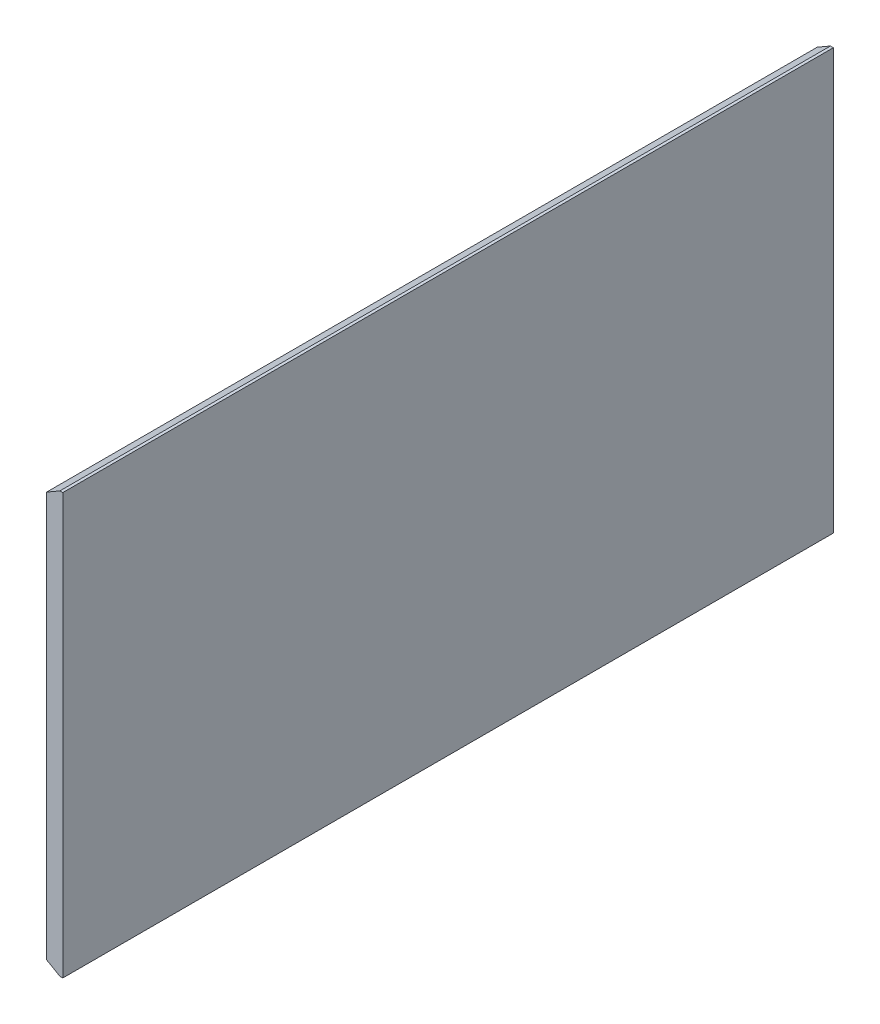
ISO-10303-21;
HEADER;
FILE_DESCRIPTION(('STEP AP214'),'2;1');
FILE_NAME('part.step','',(''),(''),'','','');
FILE_SCHEMA(('AUTOMOTIVE_DESIGN { 1 0 10303 214 1 1 1 1 }'));
ENDSEC;
DATA;
#1=APPLICATION_CONTEXT('core data for automotive mechanical design processes');
#2=APPLICATION_PROTOCOL_DEFINITION('international standard','automotive_design',2000,#1);
#3=PRODUCT_CONTEXT('',#1,'mechanical');
#4=PRODUCT('Part','Part','',(#3));
#5=PRODUCT_RELATED_PRODUCT_CATEGORY('part','',(#4));
#6=PRODUCT_DEFINITION_FORMATION('','',#4);
#7=PRODUCT_DEFINITION_CONTEXT('part definition',#1,'design');
#8=PRODUCT_DEFINITION('design','',#6,#7);
#9=PRODUCT_DEFINITION_SHAPE('','',#8);
#10=(LENGTH_UNIT() NAMED_UNIT(*) SI_UNIT(.MILLI.,.METRE.));
#11=(NAMED_UNIT(*) PLANE_ANGLE_UNIT() SI_UNIT($,.RADIAN.));
#12=(NAMED_UNIT(*) SI_UNIT($,.STERADIAN.) SOLID_ANGLE_UNIT());
#13=UNCERTAINTY_MEASURE_WITH_UNIT(LENGTH_MEASURE(1.E-05),#10,'distance_accuracy_value','');
#14=(GEOMETRIC_REPRESENTATION_CONTEXT(3) GLOBAL_UNCERTAINTY_ASSIGNED_CONTEXT((#13)) GLOBAL_UNIT_ASSIGNED_CONTEXT((#10,
#11,#12)) REPRESENTATION_CONTEXT('',''));
#15=CARTESIAN_POINT('',(0.,0.,0.));
#16=DIRECTION('',(0.,0.,1.));
#17=DIRECTION('',(1.,0.,0.));
#18=AXIS2_PLACEMENT_3D('',#15,#16,#17);
#19=CARTESIAN_POINT('',(22.225,579.,1061.35));
#20=DIRECTION('',(0.,-1.,0.));
#21=DIRECTION('',(0.,0.,-1.));
#22=AXIS2_PLACEMENT_3D('',#19,#20,#21);
#23=PLANE('',#22);
#24=DIRECTION('',(-1.,0.,0.));
#25=VECTOR('',#24,1.);
#26=CARTESIAN_POINT('',(22.225,579.,-1061.35));
#27=LINE('',#26,#25);
#28=CARTESIAN_POINT('',(22.225,579.,-1061.35));
#29=VERTEX_POINT('',#28);
#30=CARTESIAN_POINT('',(14.148066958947,579.,-1061.35));
#31=VERTEX_POINT('',#30);
#32=EDGE_CURVE('E154',#29,#31,#27,.T.);
#33=ORIENTED_EDGE('',*,*,#32,.T.);
#34=DIRECTION('',(0.,0.,1.));
#35=VECTOR('',#34,1.);
#36=CARTESIAN_POINT('',(14.148066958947,579.,1061.35));
#37=LINE('',#36,#35);
#38=CARTESIAN_POINT('',(14.148066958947,579.,1061.35));
#39=VERTEX_POINT('',#38);
#40=EDGE_CURVE('E130',#31,#39,#37,.T.);
#41=ORIENTED_EDGE('',*,*,#40,.T.);
#42=DIRECTION('',(-1.,0.,0.));
#43=VECTOR('',#42,1.);
#44=CARTESIAN_POINT('',(22.225,579.,1061.35));
#45=LINE('',#44,#43);
#46=CARTESIAN_POINT('',(22.225,579.,1061.35));
#47=VERTEX_POINT('',#46);
#48=EDGE_CURVE('E106',#47,#39,#45,.T.);
#49=ORIENTED_EDGE('',*,*,#48,.F.);
#50=DIRECTION('',(0.,0.,1.));
#51=VECTOR('',#50,1.);
#52=CARTESIAN_POINT('',(22.225,579.,1061.35));
#53=LINE('',#52,#51);
#54=EDGE_CURVE('E113',#29,#47,#53,.T.);
#55=ORIENTED_EDGE('',*,*,#54,.F.);
#56=EDGE_LOOP('',(#33,#41,#49,#55));
#57=FACE_BOUND('',#56,.T.);
#58=ADVANCED_FACE('F44',(#57),#23,.F.);
#59=CARTESIAN_POINT('',(22.225,-579.,1061.35));
#60=DIRECTION('',(0.,0.,-1.));
#61=DIRECTION('',(-1.,0.,0.));
#62=AXIS2_PLACEMENT_3D('',#59,#60,#61);
#63=PLANE('',#62);
#64=ORIENTED_EDGE('',*,*,#48,.T.);
#65=DIRECTION('',(0.866025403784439,0.5,0.));
#66=VECTOR('',#65,1.);
#67=CARTESIAN_POINT('',(14.148066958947,579.,1061.35));
#68=LINE('',#67,#66);
#69=CARTESIAN_POINT('',(-22.225,558.,1061.35));
#70=VERTEX_POINT('',#69);
#71=EDGE_CURVE('E142',#39,#70,#68,.F.);
#72=ORIENTED_EDGE('',*,*,#71,.T.);
#73=DIRECTION('',(0.,-1.,0.));
#74=VECTOR('',#73,1.);
#75=CARTESIAN_POINT('',(-22.225,-579.,1061.35));
#76=LINE('',#75,#74);
#77=CARTESIAN_POINT('',(-22.225,-558.,1061.35));
#78=VERTEX_POINT('',#77);
#79=EDGE_CURVE('E163',#70,#78,#76,.T.);
#80=ORIENTED_EDGE('',*,*,#79,.T.);
#81=DIRECTION('',(-0.866025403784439,0.5,0.));
#82=VECTOR('',#81,1.);
#83=CARTESIAN_POINT('',(14.148066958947,-579.,1061.35));
#84=LINE('',#83,#82);
#85=CARTESIAN_POINT('',(14.148066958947,-579.,1061.35));
#86=VERTEX_POINT('',#85);
#87=EDGE_CURVE('E132',#78,#86,#84,.F.);
#88=ORIENTED_EDGE('',*,*,#87,.T.);
#89=DIRECTION('',(-1.,0.,0.));
#90=VECTOR('',#89,1.);
#91=CARTESIAN_POINT('',(22.225,-579.,1061.35));
#92=LINE('',#91,#90);
#93=CARTESIAN_POINT('',(22.225,-579.,1061.35));
#94=VERTEX_POINT('',#93);
#95=EDGE_CURVE('E108',#94,#86,#92,.T.);
#96=ORIENTED_EDGE('',*,*,#95,.F.);
#97=DIRECTION('',(0.,-1.,0.));
#98=VECTOR('',#97,1.);
#99=CARTESIAN_POINT('',(22.225,-579.,1061.35));
#100=LINE('',#99,#98);
#101=EDGE_CURVE('E105',#47,#94,#100,.T.);
#102=ORIENTED_EDGE('',*,*,#101,.F.);
#103=EDGE_LOOP('',(#64,#72,#80,#88,#96,#102));
#104=FACE_BOUND('',#103,.T.);
#105=ADVANCED_FACE('F104',(#104),#63,.F.);
#106=CARTESIAN_POINT('',(22.225,-579.,1061.35));
#107=DIRECTION('',(0.,1.,0.));
#108=DIRECTION('',(0.,0.,1.));
#109=AXIS2_PLACEMENT_3D('',#106,#107,#108);
#110=PLANE('',#109);
#111=ORIENTED_EDGE('',*,*,#95,.T.);
#112=DIRECTION('',(0.,0.,-1.));
#113=VECTOR('',#112,1.);
#114=CARTESIAN_POINT('',(14.148066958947,-579.,1061.35));
#115=LINE('',#114,#113);
#116=CARTESIAN_POINT('',(14.148066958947,-579.,-1061.35));
#117=VERTEX_POINT('',#116);
#118=EDGE_CURVE('E11',#86,#117,#115,.T.);
#119=ORIENTED_EDGE('',*,*,#118,.T.);
#120=DIRECTION('',(-1.,0.,0.));
#121=VECTOR('',#120,1.);
#122=CARTESIAN_POINT('',(22.225,-579.,-1061.35));
#123=LINE('',#122,#121);
#124=CARTESIAN_POINT('',(22.225,-579.,-1061.35));
#125=VERTEX_POINT('',#124);
#126=EDGE_CURVE('E134',#125,#117,#123,.T.);
#127=ORIENTED_EDGE('',*,*,#126,.F.);
#128=DIRECTION('',(0.,0.,-1.));
#129=VECTOR('',#128,1.);
#130=CARTESIAN_POINT('',(22.225,-579.,1061.35));
#131=LINE('',#130,#129);
#132=EDGE_CURVE('E115',#94,#125,#131,.T.);
#133=ORIENTED_EDGE('',*,*,#132,.F.);
#134=EDGE_LOOP('',(#111,#119,#127,#133));
#135=FACE_BOUND('',#134,.T.);
#136=ADVANCED_FACE('F176',(#135),#110,.F.);
#137=CARTESIAN_POINT('',(22.225,-579.,-1061.35));
#138=DIRECTION('',(0.,0.,1.));
#139=DIRECTION('',(1.,0.,0.));
#140=AXIS2_PLACEMENT_3D('',#137,#138,#139);
#141=PLANE('',#140);
#142=DIRECTION('',(0.,1.,0.));
#143=VECTOR('',#142,1.);
#144=CARTESIAN_POINT('',(-22.225,-579.,-1061.35));
#145=LINE('',#144,#143);
#146=CARTESIAN_POINT('',(-22.225,-557.999999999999,-1061.35));
#147=VERTEX_POINT('',#146);
#148=CARTESIAN_POINT('',(-22.225,558.,-1061.35));
#149=VERTEX_POINT('',#148);
#150=EDGE_CURVE('E124',#147,#149,#145,.T.);
#151=ORIENTED_EDGE('',*,*,#150,.T.);
#152=DIRECTION('',(-0.866025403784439,-0.5,0.));
#153=VECTOR('',#152,1.);
#154=CARTESIAN_POINT('',(14.1480669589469,579.,-1061.35));
#155=LINE('',#154,#153);
#156=EDGE_CURVE('E54',#149,#31,#155,.F.);
#157=ORIENTED_EDGE('',*,*,#156,.T.);
#158=ORIENTED_EDGE('',*,*,#32,.F.);
#159=DIRECTION('',(0.,1.,0.));
#160=VECTOR('',#159,1.);
#161=CARTESIAN_POINT('',(22.225,-579.,-1061.35));
#162=LINE('',#161,#160);
#163=EDGE_CURVE('E117',#125,#29,#162,.T.);
#164=ORIENTED_EDGE('',*,*,#163,.F.);
#165=ORIENTED_EDGE('',*,*,#126,.T.);
#166=DIRECTION('',(0.866025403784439,-0.5,0.));
#167=VECTOR('',#166,1.);
#168=CARTESIAN_POINT('',(14.1480669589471,-579.,-1061.35));
#169=LINE('',#168,#167);
#170=EDGE_CURVE('E65',#117,#147,#169,.F.);
#171=ORIENTED_EDGE('',*,*,#170,.T.);
#172=EDGE_LOOP('',(#151,#157,#158,#164,#165,#171));
#173=FACE_BOUND('',#172,.T.);
#174=ADVANCED_FACE('F153',(#173),#141,.F.);
#175=CARTESIAN_POINT('',(22.225,0.,0.));
#176=DIRECTION('',(1.,0.,0.));
#177=DIRECTION('',(0.,0.,-1.));
#178=AXIS2_PLACEMENT_3D('',#175,#176,#177);
#179=PLANE('',#178);
#180=ORIENTED_EDGE('',*,*,#54,.T.);
#181=ORIENTED_EDGE('',*,*,#101,.T.);
#182=ORIENTED_EDGE('',*,*,#132,.T.);
#183=ORIENTED_EDGE('',*,*,#163,.T.);
#184=EDGE_LOOP('',(#180,#181,#182,#183));
#185=FACE_BOUND('',#184,.T.);
#186=ADVANCED_FACE('F116',(#185),#179,.T.);
#187=CARTESIAN_POINT('',(-22.225,0.,0.));
#188=DIRECTION('',(1.,0.,0.));
#189=DIRECTION('',(0.,0.,-1.));
#190=AXIS2_PLACEMENT_3D('',#187,#188,#189);
#191=PLANE('',#190);
#192=ORIENTED_EDGE('',*,*,#79,.F.);
#193=DIRECTION('',(0.,0.,-1.));
#194=VECTOR('',#193,1.);
#195=CARTESIAN_POINT('',(-22.225,558.,0.));
#196=LINE('',#195,#194);
#197=EDGE_CURVE('E68',#70,#149,#196,.T.);
#198=ORIENTED_EDGE('',*,*,#197,.T.);
#199=ORIENTED_EDGE('',*,*,#150,.F.);
#200=DIRECTION('',(0.,0.,1.));
#201=VECTOR('',#200,1.);
#202=CARTESIAN_POINT('',(-22.225,-557.999999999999,0.));
#203=LINE('',#202,#201);
#204=EDGE_CURVE('E144',#147,#78,#203,.T.);
#205=ORIENTED_EDGE('',*,*,#204,.T.);
#206=EDGE_LOOP('',(#192,#198,#199,#205));
#207=FACE_BOUND('',#206,.T.);
#208=ADVANCED_FACE('F161',(#207),#191,.F.);
#209=CARTESIAN_POINT('',(14.148066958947,579.,1061.35));
#210=DIRECTION('',(0.5,-0.866025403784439,0.));
#211=DIRECTION('',(0.,0.,1.));
#212=AXIS2_PLACEMENT_3D('',#209,#210,#211);
#213=PLANE('',#212);
#214=ORIENTED_EDGE('',*,*,#156,.F.);
#215=ORIENTED_EDGE('',*,*,#197,.F.);
#216=ORIENTED_EDGE('',*,*,#71,.F.);
#217=ORIENTED_EDGE('',*,*,#40,.F.);
#218=EDGE_LOOP('',(#214,#215,#216,#217));
#219=FACE_BOUND('',#218,.T.);
#220=ADVANCED_FACE('F158',(#219),#213,.F.);
#221=CARTESIAN_POINT('',(14.148066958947,-579.,1061.35));
#222=DIRECTION('',(0.5,0.866025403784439,0.));
#223=DIRECTION('',(0.,0.,-1.));
#224=AXIS2_PLACEMENT_3D('',#221,#222,#223);
#225=PLANE('',#224);
#226=ORIENTED_EDGE('',*,*,#87,.F.);
#227=ORIENTED_EDGE('',*,*,#204,.F.);
#228=ORIENTED_EDGE('',*,*,#170,.F.);
#229=ORIENTED_EDGE('',*,*,#118,.F.);
#230=EDGE_LOOP('',(#226,#227,#228,#229));
#231=FACE_BOUND('',#230,.T.);
#232=ADVANCED_FACE('F48',(#231),#225,.F.);
#233=CLOSED_SHELL('',(#58,#105,#136,#174,#186,#208,#220,#232));
#234=MANIFOLD_SOLID_BREP('B2',#233);
#235=ADVANCED_BREP_SHAPE_REPRESENTATION('',(#18,#234),#14);
#236=SHAPE_DEFINITION_REPRESENTATION(#9,#235);
ENDSEC;
END-ISO-10303-21;
